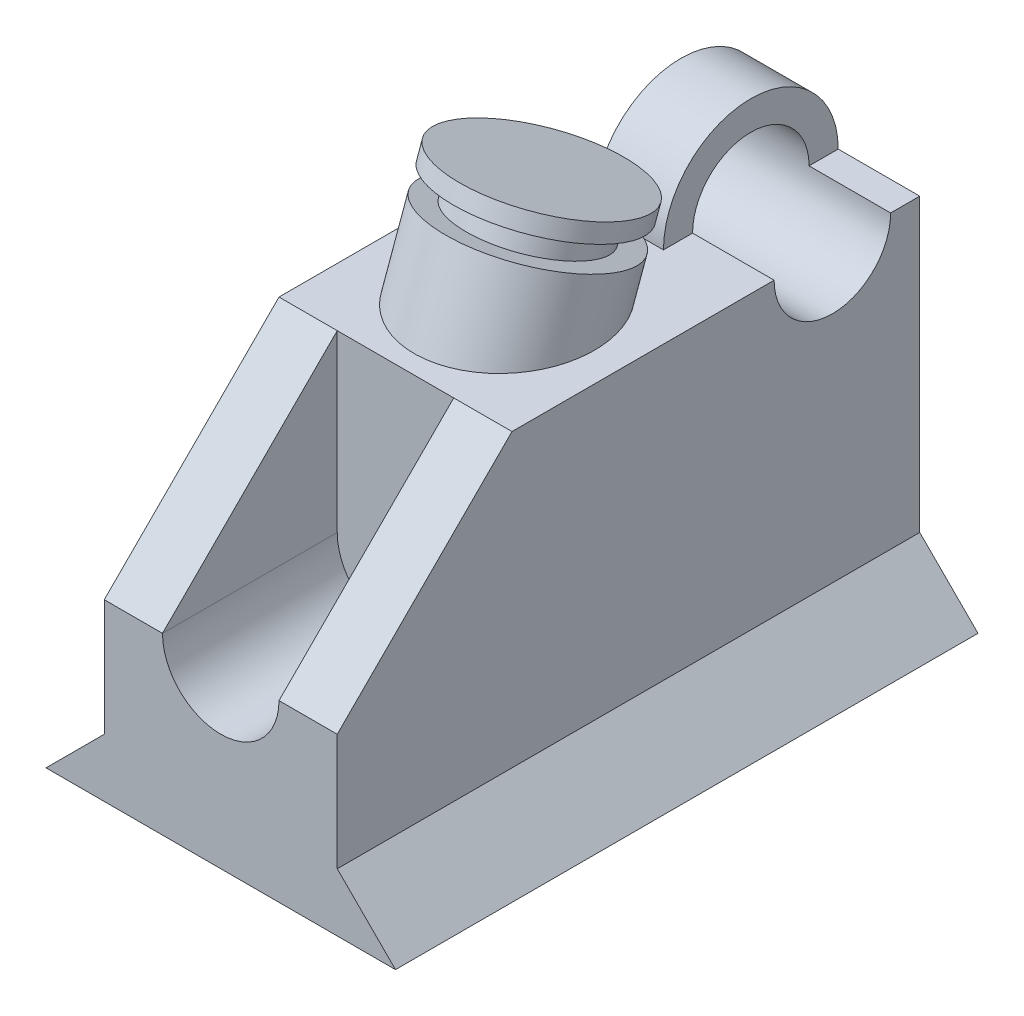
ISO-10303-21;
HEADER;
FILE_DESCRIPTION(('STEP AP214'),'2;1');
FILE_NAME('part.step','',(''),(''),'','','');
FILE_SCHEMA(('AUTOMOTIVE_DESIGN { 1 0 10303 214 1 1 1 1 }'));
ENDSEC;
DATA;
#1=APPLICATION_CONTEXT('core data for automotive mechanical design processes');
#2=APPLICATION_PROTOCOL_DEFINITION('international standard','automotive_design',2000,#1);
#3=PRODUCT_CONTEXT('',#1,'mechanical');
#4=PRODUCT('Part','Part','',(#3));
#5=PRODUCT_RELATED_PRODUCT_CATEGORY('part','',(#4));
#6=PRODUCT_DEFINITION_FORMATION('','',#4);
#7=PRODUCT_DEFINITION_CONTEXT('part definition',#1,'design');
#8=PRODUCT_DEFINITION('design','',#6,#7);
#9=PRODUCT_DEFINITION_SHAPE('','',#8);
#10=(LENGTH_UNIT() NAMED_UNIT(*) SI_UNIT(.MILLI.,.METRE.));
#11=(NAMED_UNIT(*) PLANE_ANGLE_UNIT() SI_UNIT($,.RADIAN.));
#12=(NAMED_UNIT(*) SI_UNIT($,.STERADIAN.) SOLID_ANGLE_UNIT());
#13=UNCERTAINTY_MEASURE_WITH_UNIT(LENGTH_MEASURE(1.E-05),#10,'distance_accuracy_value','');
#14=(GEOMETRIC_REPRESENTATION_CONTEXT(3) GLOBAL_UNCERTAINTY_ASSIGNED_CONTEXT((#13)) GLOBAL_UNIT_ASSIGNED_CONTEXT((#10,
#11,#12)) REPRESENTATION_CONTEXT('',''));
#15=CARTESIAN_POINT('',(0.,0.,0.));
#16=DIRECTION('',(0.,0.,1.));
#17=DIRECTION('',(1.,0.,0.));
#18=AXIS2_PLACEMENT_3D('',#15,#16,#17);
#19=CARTESIAN_POINT('',(0.,-500005.13030215,182009.667424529));
#20=DIRECTION('',(0.,0.939692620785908,-0.34202014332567));
#21=DIRECTION('',(0.,0.34202014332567,0.939692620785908));
#22=AXIS2_PLACEMENT_3D('',#19,#20,#21);
#23=CYLINDRICAL_SURFACE('',#22,15.);
#24=CARTESIAN_POINT('',(0.,59.9999999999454,0.844800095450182));
#25=DIRECTION('',(0.,-1.,0.));
#26=DIRECTION('',(0.,0.,-1.));
#27=AXIS2_PLACEMENT_3D('',#24,#25,#26);
#28=ELLIPSE('',#27,15.9626665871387,15.);
#29=CARTESIAN_POINT('',(0.,59.9999999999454,-15.1178664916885));
#30=VERTEX_POINT('',#29);
#31=EDGE_CURVE('E369',#30,#30,#28,.F.);
#32=ORIENTED_EDGE('',*,*,#31,.T.);
#33=EDGE_LOOP('',(#32));
#34=FACE_BOUND('',#33,.T.);
#35=CARTESIAN_POINT('',(0.,69.7633554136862,-2.70877066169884));
#36=DIRECTION('',(0.,-0.939692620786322,0.342020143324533));
#37=DIRECTION('',(0.,-0.342020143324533,-0.939692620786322));
#38=AXIS2_PLACEMENT_3D('',#35,#36,#37);
#39=CIRCLE('',#38,14.9999999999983);
#40=CARTESIAN_POINT('',(0.,64.6330532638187,-16.8041599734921));
#41=VERTEX_POINT('',#40);
#42=EDGE_CURVE('E380',#41,#41,#39,.T.);
#43=ORIENTED_EDGE('',*,*,#42,.T.);
#44=EDGE_LOOP('',(#43));
#45=FACE_BOUND('',#44,.T.);
#46=ADVANCED_FACE('F32',(#34,#45),#23,.T.);
#47=CARTESIAN_POINT('',(20.,60.,50.));
#48=DIRECTION('',(0.,-1.,0.));
#49=DIRECTION('',(0.,0.,-1.));
#50=AXIS2_PLACEMENT_3D('',#47,#48,#49);
#51=PLANE('',#50);
#52=DIRECTION('',(0.,0.,-1.));
#53=VECTOR('',#52,1.);
#54=CARTESIAN_POINT('',(-6.,60.,-50.));
#55=LINE('',#54,#53);
#56=CARTESIAN_POINT('',(-6.,60.,-45.));
#57=VERTEX_POINT('',#56);
#58=CARTESIAN_POINT('',(-5.99999999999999,60.,-50.));
#59=VERTEX_POINT('',#58);
#60=EDGE_CURVE('E178',#57,#59,#55,.T.);
#61=ORIENTED_EDGE('',*,*,#60,.T.);
#62=DIRECTION('',(-1.,0.,0.));
#63=VECTOR('',#62,1.);
#64=CARTESIAN_POINT('',(20.,60.,-50.));
#65=LINE('',#64,#63);
#66=CARTESIAN_POINT('',(-20.,60.,-50.));
#67=VERTEX_POINT('',#66);
#68=EDGE_CURVE('E238',#59,#67,#65,.T.);
#69=ORIENTED_EDGE('',*,*,#68,.T.);
#70=DIRECTION('',(0.,0.,-1.));
#71=VECTOR('',#70,1.);
#72=CARTESIAN_POINT('',(-20.,60.,50.));
#73=LINE('',#72,#71);
#74=CARTESIAN_POINT('',(-20.,60.,-45.));
#75=VERTEX_POINT('',#74);
#76=EDGE_CURVE('E226',#75,#67,#73,.T.);
#77=ORIENTED_EDGE('',*,*,#76,.F.);
#78=DIRECTION('',(1.,0.,0.));
#79=VECTOR('',#78,1.);
#80=CARTESIAN_POINT('',(-30.,60.,-45.));
#81=LINE('',#80,#79);
#82=EDGE_CURVE('E11',#75,#57,#81,.T.);
#83=ORIENTED_EDGE('',*,*,#82,.T.);
#84=EDGE_LOOP('',(#61,#69,#77,#83));
#85=FACE_BOUND('',#84,.T.);
#86=ADVANCED_FACE('F319',(#85),#51,.F.);
#87=CARTESIAN_POINT('',(20.,60.,-50.));
#88=VERTEX_POINT('',#87);
#89=CARTESIAN_POINT('',(6.,60.,-50.));
#90=VERTEX_POINT('',#89);
#91=EDGE_CURVE('E158',#88,#90,#65,.T.);
#92=ORIENTED_EDGE('',*,*,#91,.T.);
#93=DIRECTION('',(0.,0.,-1.));
#94=VECTOR('',#93,1.);
#95=CARTESIAN_POINT('',(6.,60.,-50.));
#96=LINE('',#95,#94);
#97=CARTESIAN_POINT('',(6.,60.,-45.));
#98=VERTEX_POINT('',#97);
#99=EDGE_CURVE('E155',#98,#90,#96,.T.);
#100=ORIENTED_EDGE('',*,*,#99,.F.);
#101=CARTESIAN_POINT('',(20.,60.,-45.));
#102=VERTEX_POINT('',#101);
#103=EDGE_CURVE('E40',#98,#102,#81,.T.);
#104=ORIENTED_EDGE('',*,*,#103,.T.);
#105=DIRECTION('',(0.,0.,-1.));
#106=VECTOR('',#105,1.);
#107=CARTESIAN_POINT('',(20.,60.,50.));
#108=LINE('',#107,#106);
#109=EDGE_CURVE('E243',#102,#88,#108,.T.);
#110=ORIENTED_EDGE('',*,*,#109,.T.);
#111=EDGE_LOOP('',(#92,#100,#104,#110));
#112=FACE_BOUND('',#111,.T.);
#113=ADVANCED_FACE('F156',(#112),#51,.F.);
#114=CARTESIAN_POINT('',(233.93596310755,30.,50.));
#115=DIRECTION('',(0.,0.707106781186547,0.707106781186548));
#116=DIRECTION('',(0.,-0.707106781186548,0.707106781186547));
#117=AXIS2_PLACEMENT_3D('',#114,#115,#116);
#118=PLANE('',#117);
#119=DIRECTION('',(0.,-0.707106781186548,0.707106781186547));
#120=VECTOR('',#119,1.);
#121=CARTESIAN_POINT('',(-10.,30.,50.));
#122=LINE('',#121,#120);
#123=CARTESIAN_POINT('',(-10.,60.,20.));
#124=VERTEX_POINT('',#123);
#125=CARTESIAN_POINT('',(-10.,30.,50.));
#126=VERTEX_POINT('',#125);
#127=EDGE_CURVE('E266',#124,#126,#122,.T.);
#128=ORIENTED_EDGE('',*,*,#127,.F.);
#129=DIRECTION('',(-1.,0.,0.));
#130=VECTOR('',#129,1.);
#131=CARTESIAN_POINT('',(233.93596310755,60.,20.));
#132=LINE('',#131,#130);
#133=CARTESIAN_POINT('',(-20.,60.,20.));
#134=VERTEX_POINT('',#133);
#135=EDGE_CURVE('E204',#124,#134,#132,.T.);
#136=ORIENTED_EDGE('',*,*,#135,.T.);
#137=DIRECTION('',(0.,-0.707106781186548,0.707106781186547));
#138=VECTOR('',#137,1.);
#139=CARTESIAN_POINT('',(-20.,20.,60.));
#140=LINE('',#139,#138);
#141=CARTESIAN_POINT('',(-20.,30.,50.));
#142=VERTEX_POINT('',#141);
#143=EDGE_CURVE('E211',#134,#142,#140,.T.);
#144=ORIENTED_EDGE('',*,*,#143,.T.);
#145=DIRECTION('',(-1.,0.,0.));
#146=VECTOR('',#145,1.);
#147=CARTESIAN_POINT('',(0.,30.,50.));
#148=LINE('',#147,#146);
#149=EDGE_CURVE('E259',#126,#142,#148,.T.);
#150=ORIENTED_EDGE('',*,*,#149,.F.);
#151=EDGE_LOOP('',(#128,#136,#144,#150));
#152=FACE_BOUND('',#151,.T.);
#153=ADVANCED_FACE('F283',(#152),#118,.T.);
#154=CARTESIAN_POINT('',(-20.,10.,50.));
#155=DIRECTION('',(1.,0.,0.));
#156=DIRECTION('',(0.,1.,0.));
#157=AXIS2_PLACEMENT_3D('',#154,#155,#156);
#158=PLANE('',#157);
#159=CARTESIAN_POINT('',(-20.,60.,-25.));
#160=VERTEX_POINT('',#159);
#161=EDGE_CURVE('E240',#134,#160,#73,.T.);
#162=ORIENTED_EDGE('',*,*,#161,.T.);
#163=CARTESIAN_POINT('',(-20.,60.,-35.));
#164=DIRECTION('',(1.,0.,0.));
#165=DIRECTION('',(0.,1.,0.));
#166=AXIS2_PLACEMENT_3D('',#163,#164,#165);
#167=CIRCLE('',#166,10.);
#168=EDGE_CURVE('E184',#160,#75,#167,.T.);
#169=ORIENTED_EDGE('',*,*,#168,.T.);
#170=ORIENTED_EDGE('',*,*,#76,.T.);
#171=DIRECTION('',(0.,-1.,0.));
#172=VECTOR('',#171,1.);
#173=CARTESIAN_POINT('',(-20.,10.,-50.));
#174=LINE('',#173,#172);
#175=CARTESIAN_POINT('',(-20.,10.,-50.));
#176=VERTEX_POINT('',#175);
#177=EDGE_CURVE('E214',#67,#176,#174,.T.);
#178=ORIENTED_EDGE('',*,*,#177,.T.);
#179=DIRECTION('',(0.,0.,-1.));
#180=VECTOR('',#179,1.);
#181=CARTESIAN_POINT('',(-20.,10.,50.));
#182=LINE('',#181,#180);
#183=CARTESIAN_POINT('',(-20.,10.,50.));
#184=VERTEX_POINT('',#183);
#185=EDGE_CURVE('E256',#184,#176,#182,.T.);
#186=ORIENTED_EDGE('',*,*,#185,.F.);
#187=DIRECTION('',(0.,-1.,0.));
#188=VECTOR('',#187,1.);
#189=CARTESIAN_POINT('',(-20.,10.,50.));
#190=LINE('',#189,#188);
#191=EDGE_CURVE('E215',#142,#184,#190,.T.);
#192=ORIENTED_EDGE('',*,*,#191,.F.);
#193=ORIENTED_EDGE('',*,*,#143,.F.);
#194=EDGE_LOOP('',(#162,#169,#170,#178,#186,#192,#193));
#195=FACE_BOUND('',#194,.T.);
#196=ADVANCED_FACE('F34',(#195),#158,.F.);
#197=CARTESIAN_POINT('',(20.,10.,50.));
#198=DIRECTION('',(-1.,0.,0.));
#199=DIRECTION('',(0.,0.,1.));
#200=AXIS2_PLACEMENT_3D('',#197,#198,#199);
#201=PLANE('',#200);
#202=ORIENTED_EDGE('',*,*,#109,.F.);
#203=CARTESIAN_POINT('',(20.,60.,-35.));
#204=DIRECTION('',(1.,0.,0.));
#205=DIRECTION('',(0.,0.,-1.));
#206=AXIS2_PLACEMENT_3D('',#203,#204,#205);
#207=CIRCLE('',#206,10.);
#208=CARTESIAN_POINT('',(20.,60.,-25.));
#209=VERTEX_POINT('',#208);
#210=EDGE_CURVE('E149',#209,#102,#207,.T.);
#211=ORIENTED_EDGE('',*,*,#210,.F.);
#212=CARTESIAN_POINT('',(20.,60.,20.));
#213=VERTEX_POINT('',#212);
#214=EDGE_CURVE('E244',#213,#209,#108,.T.);
#215=ORIENTED_EDGE('',*,*,#214,.F.);
#216=DIRECTION('',(0.,0.707106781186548,-0.707106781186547));
#217=VECTOR('',#216,1.);
#218=CARTESIAN_POINT('',(20.,20.,60.));
#219=LINE('',#218,#217);
#220=CARTESIAN_POINT('',(20.,30.,50.));
#221=VERTEX_POINT('',#220);
#222=EDGE_CURVE('E209',#221,#213,#219,.T.);
#223=ORIENTED_EDGE('',*,*,#222,.F.);
#224=DIRECTION('',(0.,1.,0.));
#225=VECTOR('',#224,1.);
#226=CARTESIAN_POINT('',(20.,10.,50.));
#227=LINE('',#226,#225);
#228=CARTESIAN_POINT('',(20.,10.,50.));
#229=VERTEX_POINT('',#228);
#230=EDGE_CURVE('E223',#229,#221,#227,.T.);
#231=ORIENTED_EDGE('',*,*,#230,.F.);
#232=DIRECTION('',(0.,0.,-1.));
#233=VECTOR('',#232,1.);
#234=CARTESIAN_POINT('',(20.,10.,50.));
#235=LINE('',#234,#233);
#236=CARTESIAN_POINT('',(20.,10.,-50.));
#237=VERTEX_POINT('',#236);
#238=EDGE_CURVE('E247',#229,#237,#235,.T.);
#239=ORIENTED_EDGE('',*,*,#238,.T.);
#240=DIRECTION('',(0.,1.,0.));
#241=VECTOR('',#240,1.);
#242=CARTESIAN_POINT('',(20.,10.,-50.));
#243=LINE('',#242,#241);
#244=EDGE_CURVE('E235',#237,#88,#243,.T.);
#245=ORIENTED_EDGE('',*,*,#244,.T.);
#246=EDGE_LOOP('',(#202,#211,#215,#223,#231,#239,#245));
#247=FACE_BOUND('',#246,.T.);
#248=ADVANCED_FACE('F295',(#247),#201,.F.);
#249=ORIENTED_EDGE('',*,*,#31,.F.);
#250=EDGE_LOOP('',(#249));
#251=FACE_BOUND('',#250,.T.);
#252=DIRECTION('',(1.,0.,0.));
#253=VECTOR('',#252,1.);
#254=CARTESIAN_POINT('',(-30.,60.,-25.));
#255=LINE('',#254,#253);
#256=CARTESIAN_POINT('',(6.,60.,-25.));
#257=VERTEX_POINT('',#256);
#258=EDGE_CURVE('E152',#209,#257,#255,.F.);
#259=ORIENTED_EDGE('',*,*,#258,.T.);
#260=DIRECTION('',(0.,0.,-1.));
#261=VECTOR('',#260,1.);
#262=CARTESIAN_POINT('',(6.,60.,-20.));
#263=LINE('',#262,#261);
#264=CARTESIAN_POINT('',(6.,60.,-20.));
#265=VERTEX_POINT('',#264);
#266=EDGE_CURVE('E47',#265,#257,#263,.T.);
#267=ORIENTED_EDGE('',*,*,#266,.F.);
#268=DIRECTION('',(-1.,0.,0.));
#269=VECTOR('',#268,1.);
#270=CARTESIAN_POINT('',(6.,60.,-20.));
#271=LINE('',#270,#269);
#272=CARTESIAN_POINT('',(-6.,60.,-20.));
#273=VERTEX_POINT('',#272);
#274=EDGE_CURVE('E52',#265,#273,#271,.T.);
#275=ORIENTED_EDGE('',*,*,#274,.T.);
#276=DIRECTION('',(0.,0.,-1.));
#277=VECTOR('',#276,1.);
#278=CARTESIAN_POINT('',(-6.,60.,-20.));
#279=LINE('',#278,#277);
#280=CARTESIAN_POINT('',(-6.,60.,-25.));
#281=VERTEX_POINT('',#280);
#282=EDGE_CURVE('E172',#273,#281,#279,.T.);
#283=ORIENTED_EDGE('',*,*,#282,.T.);
#284=EDGE_CURVE('E267',#281,#160,#255,.F.);
#285=ORIENTED_EDGE('',*,*,#284,.T.);
#286=ORIENTED_EDGE('',*,*,#161,.F.);
#287=ORIENTED_EDGE('',*,*,#135,.F.);
#288=DIRECTION('',(-1.,0.,0.));
#289=VECTOR('',#288,1.);
#290=CARTESIAN_POINT('',(-10.,60.,20.));
#291=LINE('',#290,#289);
#292=CARTESIAN_POINT('',(10.,60.,20.));
#293=VERTEX_POINT('',#292);
#294=EDGE_CURVE('E193',#293,#124,#291,.T.);
#295=ORIENTED_EDGE('',*,*,#294,.F.);
#296=EDGE_CURVE('E206',#213,#293,#132,.T.);
#297=ORIENTED_EDGE('',*,*,#296,.F.);
#298=ORIENTED_EDGE('',*,*,#214,.T.);
#299=EDGE_LOOP('',(#259,#267,#275,#283,#285,#286,#287,#295,#297,#298));
#300=FACE_BOUND('',#299,.T.);
#301=ADVANCED_FACE('F270',(#251,#300),#51,.F.);
#302=CARTESIAN_POINT('',(0.,0.,50.));
#303=DIRECTION('',(0.,0.,1.));
#304=DIRECTION('',(1.,0.,0.));
#305=AXIS2_PLACEMENT_3D('',#302,#303,#304);
#306=PLANE('',#305);
#307=CARTESIAN_POINT('',(0.,30.,50.));
#308=DIRECTION('',(0.,0.,1.));
#309=DIRECTION('',(1.,0.,0.));
#310=AXIS2_PLACEMENT_3D('',#307,#308,#309);
#311=CIRCLE('',#310,10.);
#312=CARTESIAN_POINT('',(10.,30.,50.));
#313=VERTEX_POINT('',#312);
#314=EDGE_CURVE('E187',#126,#313,#311,.T.);
#315=ORIENTED_EDGE('',*,*,#314,.F.);
#316=ORIENTED_EDGE('',*,*,#149,.T.);
#317=ORIENTED_EDGE('',*,*,#191,.T.);
#318=DIRECTION('',(-0.707106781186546,-0.707106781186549,0.));
#319=VECTOR('',#318,1.);
#320=CARTESIAN_POINT('',(-30.,0.,50.));
#321=LINE('',#320,#319);
#322=CARTESIAN_POINT('',(-30.,0.,50.));
#323=VERTEX_POINT('',#322);
#324=EDGE_CURVE('E217',#184,#323,#321,.T.);
#325=ORIENTED_EDGE('',*,*,#324,.T.);
#326=DIRECTION('',(1.,0.,0.));
#327=VECTOR('',#326,1.);
#328=CARTESIAN_POINT('',(-30.,0.,50.));
#329=LINE('',#328,#327);
#330=CARTESIAN_POINT('',(30.,0.,50.));
#331=VERTEX_POINT('',#330);
#332=EDGE_CURVE('E219',#323,#331,#329,.T.);
#333=ORIENTED_EDGE('',*,*,#332,.T.);
#334=DIRECTION('',(-0.707106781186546,0.707106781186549,0.));
#335=VECTOR('',#334,1.);
#336=CARTESIAN_POINT('',(30.,0.,50.));
#337=LINE('',#336,#335);
#338=EDGE_CURVE('E221',#331,#229,#337,.T.);
#339=ORIENTED_EDGE('',*,*,#338,.T.);
#340=ORIENTED_EDGE('',*,*,#230,.T.);
#341=EDGE_CURVE('E260',#221,#313,#148,.T.);
#342=ORIENTED_EDGE('',*,*,#341,.T.);
#343=EDGE_LOOP('',(#315,#316,#317,#325,#333,#339,#340,#342));
#344=FACE_BOUND('',#343,.T.);
#345=ADVANCED_FACE('F298',(#344),#306,.T.);
#346=CARTESIAN_POINT('',(-30.,0.,50.));
#347=DIRECTION('',(0.707106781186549,-0.707106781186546,0.));
#348=DIRECTION('',(0.707106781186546,0.707106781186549,0.));
#349=AXIS2_PLACEMENT_3D('',#346,#347,#348);
#350=PLANE('',#349);
#351=DIRECTION('',(-0.707106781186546,-0.707106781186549,0.));
#352=VECTOR('',#351,1.);
#353=CARTESIAN_POINT('',(-30.,0.,-50.));
#354=LINE('',#353,#352);
#355=CARTESIAN_POINT('',(-30.,0.,-50.));
#356=VERTEX_POINT('',#355);
#357=EDGE_CURVE('E229',#176,#356,#354,.T.);
#358=ORIENTED_EDGE('',*,*,#357,.T.);
#359=DIRECTION('',(0.,0.,-1.));
#360=VECTOR('',#359,1.);
#361=CARTESIAN_POINT('',(-30.,0.,50.));
#362=LINE('',#361,#360);
#363=EDGE_CURVE('E253',#323,#356,#362,.T.);
#364=ORIENTED_EDGE('',*,*,#363,.F.);
#365=ORIENTED_EDGE('',*,*,#324,.F.);
#366=ORIENTED_EDGE('',*,*,#185,.T.);
#367=EDGE_LOOP('',(#358,#364,#365,#366));
#368=FACE_BOUND('',#367,.T.);
#369=ADVANCED_FACE('F323',(#368),#350,.F.);
#370=CARTESIAN_POINT('',(-30.,0.,50.));
#371=DIRECTION('',(0.,1.,0.));
#372=DIRECTION('',(0.,0.,1.));
#373=AXIS2_PLACEMENT_3D('',#370,#371,#372);
#374=PLANE('',#373);
#375=DIRECTION('',(1.,0.,0.));
#376=VECTOR('',#375,1.);
#377=CARTESIAN_POINT('',(-30.,0.,-50.));
#378=LINE('',#377,#376);
#379=CARTESIAN_POINT('',(30.,0.,-50.));
#380=VERTEX_POINT('',#379);
#381=EDGE_CURVE('E231',#356,#380,#378,.T.);
#382=ORIENTED_EDGE('',*,*,#381,.T.);
#383=DIRECTION('',(0.,0.,-1.));
#384=VECTOR('',#383,1.);
#385=CARTESIAN_POINT('',(30.,0.,50.));
#386=LINE('',#385,#384);
#387=EDGE_CURVE('E250',#331,#380,#386,.T.);
#388=ORIENTED_EDGE('',*,*,#387,.F.);
#389=ORIENTED_EDGE('',*,*,#332,.F.);
#390=ORIENTED_EDGE('',*,*,#363,.T.);
#391=EDGE_LOOP('',(#382,#388,#389,#390));
#392=FACE_BOUND('',#391,.T.);
#393=ADVANCED_FACE('F485',(#392),#374,.F.);
#394=CARTESIAN_POINT('',(30.,0.,50.));
#395=DIRECTION('',(-0.707106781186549,-0.707106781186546,0.));
#396=DIRECTION('',(0.707106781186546,-0.707106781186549,0.));
#397=AXIS2_PLACEMENT_3D('',#394,#395,#396);
#398=PLANE('',#397);
#399=DIRECTION('',(-0.707106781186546,0.707106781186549,0.));
#400=VECTOR('',#399,1.);
#401=CARTESIAN_POINT('',(30.,0.,-50.));
#402=LINE('',#401,#400);
#403=EDGE_CURVE('E233',#380,#237,#402,.T.);
#404=ORIENTED_EDGE('',*,*,#403,.T.);
#405=ORIENTED_EDGE('',*,*,#238,.F.);
#406=ORIENTED_EDGE('',*,*,#338,.F.);
#407=ORIENTED_EDGE('',*,*,#387,.T.);
#408=EDGE_LOOP('',(#404,#405,#406,#407));
#409=FACE_BOUND('',#408,.T.);
#410=ADVANCED_FACE('F304',(#409),#398,.F.);
#411=CARTESIAN_POINT('',(0.,0.,-50.));
#412=DIRECTION('',(0.,0.,1.));
#413=DIRECTION('',(1.,0.,0.));
#414=AXIS2_PLACEMENT_3D('',#411,#412,#413);
#415=PLANE('',#414);
#416=ORIENTED_EDGE('',*,*,#177,.F.);
#417=ORIENTED_EDGE('',*,*,#68,.F.);
#418=DIRECTION('',(-1.,0.,0.));
#419=VECTOR('',#418,1.);
#420=CARTESIAN_POINT('',(6.,60.,-50.));
#421=LINE('',#420,#419);
#422=EDGE_CURVE('E161',#90,#59,#421,.T.);
#423=ORIENTED_EDGE('',*,*,#422,.F.);
#424=ORIENTED_EDGE('',*,*,#91,.F.);
#425=ORIENTED_EDGE('',*,*,#244,.F.);
#426=ORIENTED_EDGE('',*,*,#403,.F.);
#427=ORIENTED_EDGE('',*,*,#381,.F.);
#428=ORIENTED_EDGE('',*,*,#357,.F.);
#429=EDGE_LOOP('',(#416,#417,#423,#424,#425,#426,#427,#428));
#430=FACE_BOUND('',#429,.T.);
#431=ADVANCED_FACE('F309',(#430),#415,.F.);
#432=DIRECTION('',(0.,0.707106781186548,-0.707106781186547));
#433=VECTOR('',#432,1.);
#434=CARTESIAN_POINT('',(10.,30.,50.));
#435=LINE('',#434,#433);
#436=EDGE_CURVE('E263',#313,#293,#435,.T.);
#437=ORIENTED_EDGE('',*,*,#436,.F.);
#438=ORIENTED_EDGE('',*,*,#341,.F.);
#439=ORIENTED_EDGE('',*,*,#222,.T.);
#440=ORIENTED_EDGE('',*,*,#296,.T.);
#441=EDGE_LOOP('',(#437,#438,#439,#440));
#442=FACE_BOUND('',#441,.T.);
#443=ADVANCED_FACE('F291',(#442),#118,.T.);
#444=CARTESIAN_POINT('',(0.,30.,20.));
#445=DIRECTION('',(0.,0.,1.));
#446=DIRECTION('',(1.,0.,0.));
#447=AXIS2_PLACEMENT_3D('',#444,#445,#446);
#448=CYLINDRICAL_SURFACE('',#447,10.);
#449=ORIENTED_EDGE('',*,*,#314,.T.);
#450=DIRECTION('',(0.,0.,1.));
#451=VECTOR('',#450,1.);
#452=CARTESIAN_POINT('',(10.,30.,20.));
#453=LINE('',#452,#451);
#454=CARTESIAN_POINT('',(10.,30.,20.));
#455=VERTEX_POINT('',#454);
#456=EDGE_CURVE('E198',#455,#313,#453,.T.);
#457=ORIENTED_EDGE('',*,*,#456,.F.);
#458=CARTESIAN_POINT('',(0.,30.,20.));
#459=DIRECTION('',(0.,0.,1.));
#460=DIRECTION('',(1.,0.,0.));
#461=AXIS2_PLACEMENT_3D('',#458,#459,#460);
#462=CIRCLE('',#461,10.);
#463=CARTESIAN_POINT('',(-10.,30.,20.));
#464=VERTEX_POINT('',#463);
#465=EDGE_CURVE('E188',#464,#455,#462,.T.);
#466=ORIENTED_EDGE('',*,*,#465,.F.);
#467=DIRECTION('',(0.,0.,1.));
#468=VECTOR('',#467,1.);
#469=CARTESIAN_POINT('',(-10.,30.,20.));
#470=LINE('',#469,#468);
#471=EDGE_CURVE('E201',#464,#126,#470,.T.);
#472=ORIENTED_EDGE('',*,*,#471,.T.);
#473=EDGE_LOOP('',(#449,#457,#466,#472));
#474=FACE_BOUND('',#473,.T.);
#475=ADVANCED_FACE('F325',(#474),#448,.F.);
#476=CARTESIAN_POINT('',(-10.,30.,20.));
#477=DIRECTION('',(-1.,0.,0.));
#478=DIRECTION('',(0.,0.,1.));
#479=AXIS2_PLACEMENT_3D('',#476,#477,#478);
#480=PLANE('',#479);
#481=ORIENTED_EDGE('',*,*,#127,.T.);
#482=ORIENTED_EDGE('',*,*,#471,.F.);
#483=DIRECTION('',(0.,-1.,0.));
#484=VECTOR('',#483,1.);
#485=CARTESIAN_POINT('',(-10.,30.,20.));
#486=LINE('',#485,#484);
#487=EDGE_CURVE('E195',#124,#464,#486,.T.);
#488=ORIENTED_EDGE('',*,*,#487,.F.);
#489=EDGE_LOOP('',(#481,#482,#488));
#490=FACE_BOUND('',#489,.T.);
#491=ADVANCED_FACE('F329',(#490),#480,.F.);
#492=CARTESIAN_POINT('',(10.,60.,20.));
#493=DIRECTION('',(1.,0.,0.));
#494=DIRECTION('',(0.,0.,-1.));
#495=AXIS2_PLACEMENT_3D('',#492,#493,#494);
#496=PLANE('',#495);
#497=ORIENTED_EDGE('',*,*,#436,.T.);
#498=DIRECTION('',(0.,1.,0.));
#499=VECTOR('',#498,1.);
#500=CARTESIAN_POINT('',(10.,60.,20.));
#501=LINE('',#500,#499);
#502=EDGE_CURVE('E191',#455,#293,#501,.T.);
#503=ORIENTED_EDGE('',*,*,#502,.F.);
#504=ORIENTED_EDGE('',*,*,#456,.T.);
#505=EDGE_LOOP('',(#497,#503,#504));
#506=FACE_BOUND('',#505,.T.);
#507=ADVANCED_FACE('F332',(#506),#496,.F.);
#508=CARTESIAN_POINT('',(0.,30.,20.));
#509=DIRECTION('',(0.,0.,1.));
#510=DIRECTION('',(1.,0.,0.));
#511=AXIS2_PLACEMENT_3D('',#508,#509,#510);
#512=PLANE('',#511);
#513=ORIENTED_EDGE('',*,*,#465,.T.);
#514=ORIENTED_EDGE('',*,*,#502,.T.);
#515=ORIENTED_EDGE('',*,*,#294,.T.);
#516=ORIENTED_EDGE('',*,*,#487,.T.);
#517=EDGE_LOOP('',(#513,#514,#515,#516));
#518=FACE_BOUND('',#517,.T.);
#519=ADVANCED_FACE('F330',(#518),#512,.T.);
#520=CARTESIAN_POINT('',(-30.,60.,-35.));
#521=DIRECTION('',(1.,0.,0.));
#522=DIRECTION('',(0.,0.,-1.));
#523=AXIS2_PLACEMENT_3D('',#520,#521,#522);
#524=CYLINDRICAL_SURFACE('',#523,10.);
#525=ORIENTED_EDGE('',*,*,#284,.F.);
#526=CARTESIAN_POINT('',(-6.,60.,-35.));
#527=DIRECTION('',(-1.,0.,0.));
#528=DIRECTION('',(0.,0.,-1.));
#529=AXIS2_PLACEMENT_3D('',#526,#527,#528);
#530=CIRCLE('',#529,10.);
#531=EDGE_CURVE('E175',#281,#57,#530,.T.);
#532=ORIENTED_EDGE('',*,*,#531,.T.);
#533=ORIENTED_EDGE('',*,*,#82,.F.);
#534=ORIENTED_EDGE('',*,*,#168,.F.);
#535=EDGE_LOOP('',(#525,#532,#533,#534));
#536=FACE_BOUND('',#535,.T.);
#537=CARTESIAN_POINT('',(6.,60.,-35.));
#538=DIRECTION('',(-1.,0.,0.));
#539=DIRECTION('',(0.,0.,-1.));
#540=AXIS2_PLACEMENT_3D('',#537,#538,#539);
#541=CIRCLE('',#540,10.);
#542=EDGE_CURVE('E147',#257,#98,#541,.T.);
#543=ORIENTED_EDGE('',*,*,#542,.F.);
#544=ORIENTED_EDGE('',*,*,#258,.F.);
#545=ORIENTED_EDGE('',*,*,#210,.T.);
#546=ORIENTED_EDGE('',*,*,#103,.F.);
#547=EDGE_LOOP('',(#543,#544,#545,#546));
#548=FACE_BOUND('',#547,.T.);
#549=ADVANCED_FACE('F145',(#536,#548),#524,.F.);
#550=CARTESIAN_POINT('',(6.,60.,-35.));
#551=DIRECTION('',(-1.,0.,0.));
#552=DIRECTION('',(0.,0.,1.));
#553=AXIS2_PLACEMENT_3D('',#550,#551,#552);
#554=CYLINDRICAL_SURFACE('',#553,15.);
#555=CARTESIAN_POINT('',(-6.,60.,-35.));
#556=DIRECTION('',(1.,0.,0.));
#557=DIRECTION('',(0.,0.,-1.));
#558=AXIS2_PLACEMENT_3D('',#555,#556,#557);
#559=CIRCLE('',#558,15.);
#560=EDGE_CURVE('E169',#59,#273,#559,.T.);
#561=ORIENTED_EDGE('',*,*,#560,.T.);
#562=ORIENTED_EDGE('',*,*,#274,.F.);
#563=CARTESIAN_POINT('',(6.,60.,-35.));
#564=DIRECTION('',(1.,0.,0.));
#565=DIRECTION('',(0.,0.,-1.));
#566=AXIS2_PLACEMENT_3D('',#563,#564,#565);
#567=CIRCLE('',#566,15.);
#568=EDGE_CURVE('E165',#90,#265,#567,.T.);
#569=ORIENTED_EDGE('',*,*,#568,.F.);
#570=ORIENTED_EDGE('',*,*,#422,.T.);
#571=EDGE_LOOP('',(#561,#562,#569,#570));
#572=FACE_BOUND('',#571,.T.);
#573=ADVANCED_FACE('F314',(#572),#554,.T.);
#574=CARTESIAN_POINT('',(6.,60.,-35.));
#575=DIRECTION('',(1.,0.,0.));
#576=DIRECTION('',(0.,0.,-1.));
#577=AXIS2_PLACEMENT_3D('',#574,#575,#576);
#578=PLANE('',#577);
#579=ORIENTED_EDGE('',*,*,#568,.T.);
#580=ORIENTED_EDGE('',*,*,#266,.T.);
#581=ORIENTED_EDGE('',*,*,#542,.T.);
#582=ORIENTED_EDGE('',*,*,#99,.T.);
#583=EDGE_LOOP('',(#579,#580,#581,#582));
#584=FACE_BOUND('',#583,.T.);
#585=ADVANCED_FACE('F163',(#584),#578,.T.);
#586=CARTESIAN_POINT('',(-6.,60.,-35.));
#587=DIRECTION('',(1.,0.,0.));
#588=DIRECTION('',(0.,0.,-1.));
#589=AXIS2_PLACEMENT_3D('',#586,#587,#588);
#590=PLANE('',#589);
#591=ORIENTED_EDGE('',*,*,#560,.F.);
#592=ORIENTED_EDGE('',*,*,#60,.F.);
#593=ORIENTED_EDGE('',*,*,#531,.F.);
#594=ORIENTED_EDGE('',*,*,#282,.F.);
#595=EDGE_LOOP('',(#591,#592,#593,#594));
#596=FACE_BOUND('',#595,.T.);
#597=ADVANCED_FACE('F317',(#596),#590,.F.);
#598=CARTESIAN_POINT('',(0.,78.6524280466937,10.0185380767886));
#599=DIRECTION('',(0.,-0.939692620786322,0.342020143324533));
#600=DIRECTION('',(0.,-0.342020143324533,-0.939692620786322));
#601=AXIS2_PLACEMENT_3D('',#598,#599,#600);
#602=PLANE('',#601);
#603=CARTESIAN_POINT('',(0.,73.5221258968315,-4.07685123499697));
#604=DIRECTION('',(0.,-0.939692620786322,0.342020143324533));
#605=DIRECTION('',(0.,-0.342020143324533,-0.939692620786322));
#606=AXIS2_PLACEMENT_3D('',#603,#604,#605);
#607=CIRCLE('',#606,14.9999999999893);
#608=CARTESIAN_POINT('',(0.,68.3918237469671,-18.1722405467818));
#609=VERTEX_POINT('',#608);
#610=EDGE_CURVE('E367',#609,#609,#607,.T.);
#611=ORIENTED_EDGE('',*,*,#610,.T.);
#612=EDGE_LOOP('',(#611));
#613=FACE_BOUND('',#612,.T.);
#614=CARTESIAN_POINT('',(0.,73.5221258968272,-4.07685123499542));
#615=DIRECTION('',(0.,-0.939692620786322,0.342020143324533));
#616=DIRECTION('',(0.,-0.342020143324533,-0.939692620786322));
#617=AXIS2_PLACEMENT_3D('',#614,#615,#616);
#618=CIRCLE('',#617,11.2499999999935);
#619=CARTESIAN_POINT('',(0.,69.6743992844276,-14.6483932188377));
#620=VERTEX_POINT('',#619);
#621=EDGE_CURVE('E370',#620,#620,#618,.T.);
#622=ORIENTED_EDGE('',*,*,#621,.F.);
#623=EDGE_LOOP('',(#622));
#624=FACE_BOUND('',#623,.T.);
#625=ADVANCED_FACE('F391',(#613,#624),#602,.T.);
#626=CARTESIAN_POINT('',(0.,66.4417285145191,-1.49979734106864));
#627=DIRECTION('',(0.,-0.939692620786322,0.342020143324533));
#628=DIRECTION('',(0.,-0.342020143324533,-0.939692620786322));
#629=AXIS2_PLACEMENT_3D('',#626,#627,#628);
#630=CYLINDRICAL_SURFACE('',#629,11.2499999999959);
#631=CARTESIAN_POINT('',(0.,69.7633554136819,-2.70877066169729));
#632=DIRECTION('',(0.,-0.939692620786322,0.342020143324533));
#633=DIRECTION('',(0.,-0.342020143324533,-0.939692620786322));
#634=AXIS2_PLACEMENT_3D('',#631,#632,#633);
#635=CIRCLE('',#634,11.2499999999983);
#636=CARTESIAN_POINT('',(0.,65.9156288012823,-13.2803126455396));
#637=VERTEX_POINT('',#636);
#638=EDGE_CURVE('E374',#637,#637,#635,.T.);
#639=CARTESIAN_POINT('',(0.,69.6743992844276,-14.6483932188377));
#640=CARTESIAN_POINT('',(0.,69.6352454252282,-14.6341423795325));
#641=CARTESIAN_POINT('',(0.,69.5960915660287,-14.6198915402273));
#642=CARTESIAN_POINT('',(0.,69.5177838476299,-14.5913898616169));
#643=CARTESIAN_POINT('',(0.,69.4786299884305,-14.5771390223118));
#644=CARTESIAN_POINT('',(0.,69.4003222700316,-14.5486373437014));
#645=CARTESIAN_POINT('',(0.,69.3611684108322,-14.5343865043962));
#646=CARTESIAN_POINT('',(0.,69.2828606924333,-14.5058848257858));
#647=CARTESIAN_POINT('',(0.,69.2437068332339,-14.4916339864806));
#648=CARTESIAN_POINT('',(0.,69.165399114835,-14.4631323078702));
#649=CARTESIAN_POINT('',(0.,69.1262452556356,-14.4488814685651));
#650=CARTESIAN_POINT('',(0.,69.0479375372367,-14.4203797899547));
#651=CARTESIAN_POINT('',(0.,69.0087836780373,-14.4061289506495));
#652=CARTESIAN_POINT('',(0.,68.9304759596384,-14.3776272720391));
#653=CARTESIAN_POINT('',(0.,68.891322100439,-14.3633764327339));
#654=CARTESIAN_POINT('',(0.,68.8130143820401,-14.3348747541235));
#655=CARTESIAN_POINT('',(0.,68.7738605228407,-14.3206239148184));
#656=CARTESIAN_POINT('',(0.,68.6955528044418,-14.292122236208));
#657=CARTESIAN_POINT('',(0.,68.6563989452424,-14.2778713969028));
#658=CARTESIAN_POINT('',(0.,68.5780912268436,-14.2493697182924));
#659=CARTESIAN_POINT('',(0.,68.5389373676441,-14.2351188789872));
#660=CARTESIAN_POINT('',(0.,68.4606296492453,-14.2066172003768));
#661=CARTESIAN_POINT('',(0.,68.4214757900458,-14.1923663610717));
#662=CARTESIAN_POINT('',(0.,68.343168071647,-14.1638646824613));
#663=CARTESIAN_POINT('',(0.,68.3040142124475,-14.1496138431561));
#664=CARTESIAN_POINT('',(0.,68.2257064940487,-14.1211121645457));
#665=CARTESIAN_POINT('',(0.,68.1865526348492,-14.1068613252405));
#666=CARTESIAN_POINT('',(0.,68.1082449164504,-14.0783596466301));
#667=CARTESIAN_POINT('',(0.,68.069091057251,-14.064108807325));
#668=CARTESIAN_POINT('',(0.,67.9907833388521,-14.0356071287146));
#669=CARTESIAN_POINT('',(0.,67.9516294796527,-14.0213562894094));
#670=CARTESIAN_POINT('',(0.,67.8733217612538,-13.992854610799));
#671=CARTESIAN_POINT('',(0.,67.8341679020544,-13.9786037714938));
#672=CARTESIAN_POINT('',(0.,67.7558601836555,-13.9501020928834));
#673=CARTESIAN_POINT('',(0.,67.7167063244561,-13.9358512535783));
#674=CARTESIAN_POINT('',(0.,67.6383986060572,-13.9073495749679));
#675=CARTESIAN_POINT('',(0.,67.5992447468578,-13.8930987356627));
#676=CARTESIAN_POINT('',(0.,67.5209370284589,-13.8645970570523));
#677=CARTESIAN_POINT('',(0.,67.4817831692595,-13.8503462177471));
#678=CARTESIAN_POINT('',(0.,67.4034754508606,-13.8218445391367));
#679=CARTESIAN_POINT('',(0.,67.3643215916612,-13.8075936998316));
#680=CARTESIAN_POINT('',(0.,67.2860138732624,-13.7790920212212));
#681=CARTESIAN_POINT('',(0.,67.2468600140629,-13.764841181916));
#682=CARTESIAN_POINT('',(0.,67.1685522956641,-13.7363395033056));
#683=CARTESIAN_POINT('',(0.,67.1293984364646,-13.7220886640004));
#684=CARTESIAN_POINT('',(0.,67.0510907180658,-13.69358698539));
#685=CARTESIAN_POINT('',(0.,67.0119368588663,-13.6793361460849));
#686=CARTESIAN_POINT('',(0.,66.9336291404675,-13.6508344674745));
#687=CARTESIAN_POINT('',(0.,66.8944752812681,-13.6365836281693));
#688=CARTESIAN_POINT('',(0.,66.8161675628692,-13.6080819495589));
#689=CARTESIAN_POINT('',(0.,66.7770137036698,-13.5938311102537));
#690=CARTESIAN_POINT('',(0.,66.6987059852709,-13.5653294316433));
#691=CARTESIAN_POINT('',(0.,66.6595521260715,-13.5510785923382));
#692=CARTESIAN_POINT('',(0.,66.5812444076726,-13.5225769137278));
#693=CARTESIAN_POINT('',(0.,66.5420905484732,-13.5083260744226));
#694=CARTESIAN_POINT('',(0.,66.4637828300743,-13.4798243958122));
#695=CARTESIAN_POINT('',(0.,66.4246289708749,-13.465573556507));
#696=CARTESIAN_POINT('',(0.,66.346321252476,-13.4370718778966));
#697=CARTESIAN_POINT('',(0.,66.3071673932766,-13.4228210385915));
#698=CARTESIAN_POINT('',(0.,66.2288596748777,-13.3943193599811));
#699=CARTESIAN_POINT('',(0.,66.1897058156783,-13.3800685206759));
#700=CARTESIAN_POINT('',(0.,66.1113980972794,-13.3515668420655));
#701=CARTESIAN_POINT('',(0.,66.07224423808,-13.3373160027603));
#702=CARTESIAN_POINT('',(0.,65.9939365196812,-13.3088143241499));
#703=CARTESIAN_POINT('',(0.,65.9547826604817,-13.2945634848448));
#704=CARTESIAN_POINT('',(0.,65.9156288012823,-13.2803126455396));
#705=B_SPLINE_CURVE_WITH_KNOTS('',3,(#639,#640,#641,#642,#643,#644,#645,#646,#647,#648,#649,
#650,#651,#652,#653,#654,#655,#656,#657,#658,#659,#660,#661,#662,#663,#664,#665,#666,#667,#668,
#669,#670,#671,#672,#673,#674,#675,#676,#677,#678,#679,#680,#681,#682,#683,#684,#685,#686,#687,
#688,#689,#690,#691,#692,#693,#694,#695,#696,#697,#698,#699,#700,#701,#702,#703,#704),
.UNSPECIFIED.,.F.,.F.,(4,2,2,2,2,2,2,2,2,2,2,2,2,2,2,2,2,2,2,2,2,2,2,2,2,2,2,2,2,2,2,2,4),(0.,
0.125000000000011,0.250000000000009,0.375000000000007,0.500000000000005,0.625000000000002,
0.750000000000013,0.875000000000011,1.00000000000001,1.12500000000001,1.25,1.37500000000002,
1.50000000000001,1.62500000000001,1.75000000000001,1.87500000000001,2.,2.12500000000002,
2.25000000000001,2.37500000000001,2.50000000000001,2.62500000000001,2.75000000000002,
2.87500000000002,3.00000000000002,3.12500000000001,3.25000000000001,3.37500000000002,
3.50000000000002,3.62500000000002,3.75000000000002,3.87500000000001,4.00000000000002),.UNSPECIFIED.);
#706=EDGE_CURVE('BSEAM385',#620,#637,#705,.T.);
#707=ORIENTED_EDGE('',*,*,#621,.T.);
#708=ORIENTED_EDGE('',*,*,#638,.F.);
#709=ORIENTED_EDGE('',*,*,#706,.T.);
#710=ORIENTED_EDGE('',*,*,#706,.F.);
#711=EDGE_LOOP('',(#707,#709,#708,#710));
#712=FACE_BOUND('',#711,.T.);
#713=ADVANCED_FACE('F385',(#712),#630,.T.);
#714=CARTESIAN_POINT('',(0.,73.6110820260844,7.86277132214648));
#715=DIRECTION('',(0.,0.939692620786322,-0.342020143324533));
#716=DIRECTION('',(0.,0.342020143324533,0.939692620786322));
#717=AXIS2_PLACEMENT_3D('',#714,#715,#716);
#718=PLANE('',#717);
#719=ORIENTED_EDGE('',*,*,#638,.T.);
#720=EDGE_LOOP('',(#719));
#721=FACE_BOUND('',#720,.T.);
#722=ORIENTED_EDGE('',*,*,#42,.F.);
#723=EDGE_LOOP('',(#722));
#724=FACE_BOUND('',#723,.T.);
#725=ADVANCED_FACE('F360',(#721,#724),#718,.T.);
#726=CARTESIAN_POINT('',(0.,76.3412037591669,-5.10291166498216));
#727=DIRECTION('',(0.,0.939692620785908,-0.34202014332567));
#728=DIRECTION('',(0.,0.34202014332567,0.939692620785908));
#729=AXIS2_PLACEMENT_3D('',#726,#727,#728);
#730=PLANE('',#729);
#731=CARTESIAN_POINT('',(0.,76.3412037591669,-5.10291166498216));
#732=DIRECTION('',(0.,0.939692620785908,-0.34202014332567));
#733=DIRECTION('',(0.,0.34202014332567,0.939692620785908));
#734=AXIS2_PLACEMENT_3D('',#731,#732,#733);
#735=CIRCLE('',#734,15.);
#736=CARTESIAN_POINT('',(0.,81.4715059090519,8.99247764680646));
#737=VERTEX_POINT('',#736);
#738=EDGE_CURVE('E173',#737,#737,#735,.T.);
#739=ORIENTED_EDGE('',*,*,#738,.T.);
#740=EDGE_LOOP('',(#739));
#741=FACE_BOUND('',#740,.T.);
#742=ADVANCED_FACE('F355',(#741),#730,.T.);
#743=ORIENTED_EDGE('',*,*,#738,.F.);
#744=EDGE_LOOP('',(#743));
#745=FACE_BOUND('',#744,.T.);
#746=ORIENTED_EDGE('',*,*,#610,.F.);
#747=EDGE_LOOP('',(#746));
#748=FACE_BOUND('',#747,.T.);
#749=ADVANCED_FACE('F345',(#745,#748),#23,.T.);
#750=CLOSED_SHELL('',(#46,#86,#113,#153,#196,#248,#301,#345,#369,#393,#410,#431,#443,#475,#491,
#507,#519,#549,#573,#585,#597,#625,#713,#725,#742,#749));
#751=MANIFOLD_SOLID_BREP('B2',#750);
#752=ADVANCED_BREP_SHAPE_REPRESENTATION('',(#18,#751),#14);
#753=SHAPE_DEFINITION_REPRESENTATION(#9,#752);
ENDSEC;
END-ISO-10303-21;
